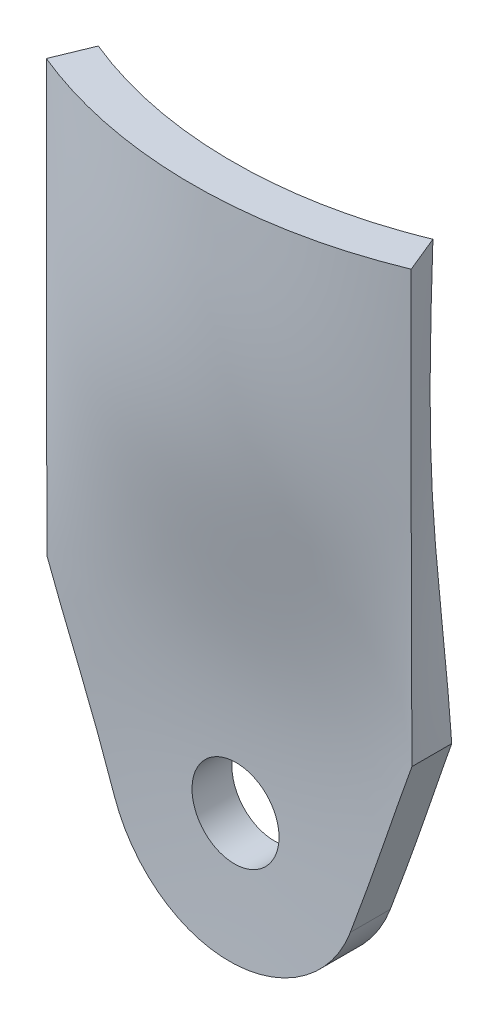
ISO-10303-21;
HEADER;
FILE_DESCRIPTION(('STEP AP214'),'2;1');
FILE_NAME('part.step','',(''),(''),'','','');
FILE_SCHEMA(('AUTOMOTIVE_DESIGN { 1 0 10303 214 1 1 1 1 }'));
ENDSEC;
DATA;
#1=APPLICATION_CONTEXT('core data for automotive mechanical design processes');
#2=APPLICATION_PROTOCOL_DEFINITION('international standard','automotive_design',2000,#1);
#3=PRODUCT_CONTEXT('',#1,'mechanical');
#4=PRODUCT('Part','Part','',(#3));
#5=PRODUCT_RELATED_PRODUCT_CATEGORY('part','',(#4));
#6=PRODUCT_DEFINITION_FORMATION('','',#4);
#7=PRODUCT_DEFINITION_CONTEXT('part definition',#1,'design');
#8=PRODUCT_DEFINITION('design','',#6,#7);
#9=PRODUCT_DEFINITION_SHAPE('','',#8);
#10=(LENGTH_UNIT() NAMED_UNIT(*) SI_UNIT(.MILLI.,.METRE.));
#11=(NAMED_UNIT(*) PLANE_ANGLE_UNIT() SI_UNIT($,.RADIAN.));
#12=(NAMED_UNIT(*) SI_UNIT($,.STERADIAN.) SOLID_ANGLE_UNIT());
#13=UNCERTAINTY_MEASURE_WITH_UNIT(LENGTH_MEASURE(1.E-05),#10,'distance_accuracy_value','');
#14=(GEOMETRIC_REPRESENTATION_CONTEXT(3) GLOBAL_UNCERTAINTY_ASSIGNED_CONTEXT((#13)) GLOBAL_UNIT_ASSIGNED_CONTEXT((#10,
#11,#12)) REPRESENTATION_CONTEXT('',''));
#15=CARTESIAN_POINT('',(0.,0.,0.));
#16=DIRECTION('',(0.,0.,1.));
#17=DIRECTION('',(1.,0.,0.));
#18=AXIS2_PLACEMENT_3D('',#15,#16,#17);
#19=CARTESIAN_POINT('',(27.6985551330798,35.052,6.14951913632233));
#20=CARTESIAN_POINT('',(27.698555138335,23.3475875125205,6.16319708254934));
#21=CARTESIAN_POINT('',(27.6985551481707,1.44104880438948,6.18879738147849));
#22=CARTESIAN_POINT('',(27.6985550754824,-33.2958353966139,5.99960558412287));
#23=CARTESIAN_POINT('',(27.698555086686,-56.6745810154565,6.02876615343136));
#24=CARTESIAN_POINT('',(27.698555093,-69.85,6.0452));
#25=CARTESIAN_POINT('',(9.95387424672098,35.052,13.4444482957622));
#26=CARTESIAN_POINT('',(10.0484121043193,23.3475875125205,14.4146108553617));
#27=CARTESIAN_POINT('',(10.2253536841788,1.44104880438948,16.2304135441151));
#28=CARTESIAN_POINT('',(8.9177167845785,-33.2958353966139,2.81123530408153));
#29=CARTESIAN_POINT('',(9.1192658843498,-56.6745810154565,4.87956428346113));
#30=CARTESIAN_POINT('',(9.23285169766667,-69.85,6.0452));
#31=CARTESIAN_POINT('',(-9.95387424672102,35.052,13.4444482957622));
#32=CARTESIAN_POINT('',(-10.0484121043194,23.3475875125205,14.4146108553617));
#33=CARTESIAN_POINT('',(-10.2253536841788,1.44104880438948,16.2304135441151));
#34=CARTESIAN_POINT('',(-8.91771678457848,-33.2958353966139,2.81123530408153));
#35=CARTESIAN_POINT('',(-9.11926588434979,-56.6745810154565,4.87956428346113));
#36=CARTESIAN_POINT('',(-9.23285169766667,-69.85,6.0452));
#37=CARTESIAN_POINT('',(-27.6985551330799,35.052,6.14951913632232));
#38=CARTESIAN_POINT('',(-27.698555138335,23.3475875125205,6.16319708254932));
#39=CARTESIAN_POINT('',(-27.6985551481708,1.44104880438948,6.18879738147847));
#40=CARTESIAN_POINT('',(-27.6985550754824,-33.2958353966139,5.99960558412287));
#41=CARTESIAN_POINT('',(-27.698555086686,-56.6745810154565,6.02876615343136));
#42=CARTESIAN_POINT('',(-27.698555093,-69.85,6.0452));
#43=B_SPLINE_SURFACE_WITH_KNOTS('',3,3,((#19,#20,#21,#22,#23,#24),(#25,#26,#27,#28,#29,#30),
(#31,#32,#33,#34,#35,#36),(#37,#38,#39,#40,#41,#42)),.UNSPECIFIED.,.F.,.F.,.F.,(4,4),(4,1,1,4),
(0.,1.),(0.,0.333645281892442,0.624466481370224,1.),.UNSPECIFIED.);
#44=CARTESIAN_POINT('',(-6.604,-50.8,5.12480998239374));
#45=CARTESIAN_POINT('',(-6.60400134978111,-50.6144803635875,5.12127502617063));
#46=CARTESIAN_POINT('',(-6.59617938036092,-50.4289807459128,5.11784925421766));
#47=CARTESIAN_POINT('',(-6.56494505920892,-50.0592335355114,5.11124221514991));
#48=CARTESIAN_POINT('',(-6.54152862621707,-49.8749862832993,5.108061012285));
#49=CARTESIAN_POINT('',(-6.47923724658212,-49.5089541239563,5.10196573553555));
#50=CARTESIAN_POINT('',(-6.44034861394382,-49.3271715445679,5.09905190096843));
#51=CARTESIAN_POINT('',(-6.34737205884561,-48.967459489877,5.09351260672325));
#52=CARTESIAN_POINT('',(-6.29327858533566,-48.7895314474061,5.0908872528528));
#53=CARTESIAN_POINT('',(-6.17033369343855,-48.4390119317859,5.08594174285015));
#54=CARTESIAN_POINT('',(-6.10149461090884,-48.2664161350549,5.08362133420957));
#55=CARTESIAN_POINT('',(-5.9494924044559,-47.9275709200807,5.07928937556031));
#56=CARTESIAN_POINT('',(-5.86632400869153,-47.7613238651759,5.07727793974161));
#57=CARTESIAN_POINT('',(-5.68632744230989,-47.4365273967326,5.0735660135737));
#58=CARTESIAN_POINT('',(-5.58950772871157,-47.2779732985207,5.07186533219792));
#59=CARTESIAN_POINT('',(-5.38281926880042,-46.9695234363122,5.0687651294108));
#60=CARTESIAN_POINT('',(-5.27294572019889,-46.8196308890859,5.06736571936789));
#61=CARTESIAN_POINT('',(-5.0410076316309,-46.5296945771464,5.06485395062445));
#62=CARTESIAN_POINT('',(-4.91894817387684,-46.3896467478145,5.06374147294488));
#63=CARTESIAN_POINT('',(-4.66342021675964,-46.1202773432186,5.06177961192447));
#64=CARTESIAN_POINT('',(-4.5299475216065,-45.9909597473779,5.06093032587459));
#65=CARTESIAN_POINT('',(-4.25262696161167,-45.7440694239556,5.05946616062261));
#66=CARTESIAN_POINT('',(-4.10878253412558,-45.6264928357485,5.05885120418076));
#67=CARTESIAN_POINT('',(-3.81164692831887,-45.4038306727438,5.0578203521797));
#68=CARTESIAN_POINT('',(-3.65835228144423,-45.2987497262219,5.05740453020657));
#69=CARTESIAN_POINT('',(-3.34351713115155,-45.1019159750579,5.05673411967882));
#70=CARTESIAN_POINT('',(-3.18197993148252,-45.0101578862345,5.05647946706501));
#71=CARTESIAN_POINT('',(-2.8516907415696,-44.8405407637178,5.05609150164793));
#72=CARTESIAN_POINT('',(-2.6829361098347,-44.7626868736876,5.05595823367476));
#73=CARTESIAN_POINT('',(-2.33953041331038,-44.6214998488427,5.05577473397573));
#74=CARTESIAN_POINT('',(-2.16488155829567,-44.5581613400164,5.05572447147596));
#75=CARTESIAN_POINT('',(-1.81080823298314,-44.4463968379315,5.05567207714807));
#76=CARTESIAN_POINT('',(-1.63138202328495,-44.3979763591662,5.05566996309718));
#77=CARTESIAN_POINT('',(-1.26912714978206,-44.3164382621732,5.05568481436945));
#78=CARTESIAN_POINT('',(-1.0862994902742,-44.2833161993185,5.0557017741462));
#79=CARTESIAN_POINT('',(-0.718487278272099,-44.2325709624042,5.05573441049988));
#80=CARTESIAN_POINT('',(-0.533501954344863,-44.2149535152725,5.05575008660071));
#81=CARTESIAN_POINT('',(0.0225816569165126,-44.1856413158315,5.05577442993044));
#82=CARTESIAN_POINT('',(0.395202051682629,-44.1973982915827,5.05576049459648));
#83=CARTESIAN_POINT('',(1.13298280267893,-44.2833061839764,5.05569956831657));
#84=CARTESIAN_POINT('',(1.49814303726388,-44.3574581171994,5.05565257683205));
#85=CARTESIAN_POINT('',(2.21088660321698,-44.5660138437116,5.05571328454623));
#86=CARTESIAN_POINT('',(2.55846991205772,-44.7004177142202,5.05582098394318));
#87=CARTESIAN_POINT('',(3.2261227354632,-45.0256717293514,5.05648118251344));
#88=CARTESIAN_POINT('',(3.54619233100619,-45.2165217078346,5.05703368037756));
#89=CARTESIAN_POINT('',(4.1497500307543,-45.6492463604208,5.05890185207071));
#90=CARTESIAN_POINT('',(4.43323817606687,-45.8911209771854,5.06021752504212));
#91=CARTESIAN_POINT('',(4.95556452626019,-46.4190110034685,5.06388247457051));
#92=CARTESIAN_POINT('',(5.19440533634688,-46.7050238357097,5.06623169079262));
#93=CARTESIAN_POINT('',(5.6206797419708,-47.313076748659,5.0721327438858));
#94=CARTESIAN_POINT('',(5.8081133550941,-47.6351168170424,5.07568458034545));
#95=CARTESIAN_POINT('',(6.12624842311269,-48.3060606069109,5.08403649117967));
#96=CARTESIAN_POINT('',(6.256952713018,-48.6549629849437,5.08883650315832));
#97=CARTESIAN_POINT('',(6.45794056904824,-49.3697394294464,5.09961443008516));
#98=CARTESIAN_POINT('',(6.52822409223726,-49.7356135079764,5.10559234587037));
#99=CARTESIAN_POINT('',(6.6063903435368,-50.4740025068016,5.11856293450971));
#100=CARTESIAN_POINT('',(6.61426418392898,-50.8465183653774,5.12555575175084));
#101=CARTESIAN_POINT('',(6.56737300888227,-51.5875709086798,5.14032106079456));
#102=CARTESIAN_POINT('',(6.51260789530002,-51.9561075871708,5.14809355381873));
#103=CARTESIAN_POINT('',(6.34197507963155,-52.6788488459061,5.16413032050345));
#104=CARTESIAN_POINT('',(6.22609065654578,-53.0330494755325,5.17239472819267));
#105=CARTESIAN_POINT('',(5.93650059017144,-53.716963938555,5.18907267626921));
#106=CARTESIAN_POINT('',(5.76279486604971,-54.0466777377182,5.19748621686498));
#107=CARTESIAN_POINT('',(5.36245078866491,-54.6723231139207,5.21407562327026));
#108=CARTESIAN_POINT('',(5.13580270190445,-54.9682484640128,5.22225144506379));
#109=CARTESIAN_POINT('',(4.63602379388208,-55.5178457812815,5.23793753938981));
#110=CARTESIAN_POINT('',(4.36289295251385,-55.7715177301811,5.24544781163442));
#111=CARTESIAN_POINT('',(3.77790610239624,-56.229379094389,5.2593621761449));
#112=CARTESIAN_POINT('',(3.46605396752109,-56.4335734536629,5.26576637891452));
#113=CARTESIAN_POINT('',(2.81252134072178,-56.786700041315,5.27705506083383));
#114=CARTESIAN_POINT('',(2.4708409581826,-56.9356324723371,5.28193954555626));
#115=CARTESIAN_POINT('',(1.76724924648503,-57.1739580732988,5.2898454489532));
#116=CARTESIAN_POINT('',(1.40534668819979,-57.2633768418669,5.29286766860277));
#117=CARTESIAN_POINT('',(0.855451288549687,-57.3510046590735,5.29584116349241));
#118=CARTESIAN_POINT('',(0.670878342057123,-57.3724628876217,5.29657232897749));
#119=CARTESIAN_POINT('',(0.300598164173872,-57.3997615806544,5.29750328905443));
#120=CARTESIAN_POINT('',(0.114891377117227,-57.4056078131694,5.2977032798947));
#121=CARTESIAN_POINT('',(-0.256326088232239,-57.4016349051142,5.29756761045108));
#122=CARTESIAN_POINT('',(-0.441836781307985,-57.3918170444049,5.29723199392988));
#123=CARTESIAN_POINT('',(-0.811305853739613,-57.3566010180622,5.29603204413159));
#124=CARTESIAN_POINT('',(-0.995264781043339,-57.3312086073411,5.29516790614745));
#125=CARTESIAN_POINT('',(-1.36045575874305,-57.2650156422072,5.29292679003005));
#126=CARTESIAN_POINT('',(-1.54168677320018,-57.2242093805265,5.29154962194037));
#127=CARTESIAN_POINT('',(-1.89999857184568,-57.1274989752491,5.28830857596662));
#128=CARTESIAN_POINT('',(-2.07708086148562,-57.071600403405,5.2864448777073));
#129=CARTESIAN_POINT('',(-2.42597384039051,-56.9450723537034,5.28226346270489));
#130=CARTESIAN_POINT('',(-2.59778247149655,-56.8744372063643,5.27994557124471));
#131=CARTESIAN_POINT('',(-2.93477403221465,-56.718981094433,5.27489802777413));
#132=CARTESIAN_POINT('',(-3.09995938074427,-56.6341653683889,5.27216852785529));
#133=CARTESIAN_POINT('',(-3.42265295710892,-56.4509028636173,5.26634266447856));
#134=CARTESIAN_POINT('',(-3.58015862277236,-56.3524515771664,5.26324617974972));
#135=CARTESIAN_POINT('',(-3.88625989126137,-56.1426784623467,5.25673897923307));
#136=CARTESIAN_POINT('',(-4.03485875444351,-56.0313613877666,5.25332837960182));
#137=CARTESIAN_POINT('',(-4.32225823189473,-55.796534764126,5.24624276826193));
#138=CARTESIAN_POINT('',(-4.46105181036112,-55.6730166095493,5.24256757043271));
#139=CARTESIAN_POINT('',(-4.72769023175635,-55.4147799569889,5.23501095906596));
#140=CARTESIAN_POINT('',(-4.85553908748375,-55.2800656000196,5.23112962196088));
#141=CARTESIAN_POINT('',(-5.09951435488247,-55.0002670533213,5.22321159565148));
#142=CARTESIAN_POINT('',(-5.21563346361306,-54.8551764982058,5.21917481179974));
#143=CARTESIAN_POINT('',(-5.4351941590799,-54.5557859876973,5.21100323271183));
#144=CARTESIAN_POINT('',(-5.53864039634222,-54.4014894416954,5.20686847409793));
#145=CARTESIAN_POINT('',(-5.7322948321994,-54.0845314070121,5.198545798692));
#146=CARTESIAN_POINT('',(-5.82248597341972,-53.9218594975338,5.19435782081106));
#147=CARTESIAN_POINT('',(-5.988800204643,-53.5895517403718,5.18598476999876));
#148=CARTESIAN_POINT('',(-6.06492842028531,-53.4199184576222,5.18179969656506));
#149=CARTESIAN_POINT('',(-6.20255529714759,-53.074987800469,5.17348097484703));
#150=CARTESIAN_POINT('',(-6.26406687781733,-52.899695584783,5.16934728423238));
#151=CARTESIAN_POINT('',(-6.37209462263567,-52.5446101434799,5.16117221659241));
#152=CARTESIAN_POINT('',(-6.41861471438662,-52.3648181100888,5.15713081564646));
#153=CARTESIAN_POINT('',(-6.5061348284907,-51.9562631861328,5.14817806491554));
#154=CARTESIAN_POINT('',(-6.54280251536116,-51.7265585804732,5.14330361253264));
#155=CARTESIAN_POINT('',(-6.59173425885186,-51.2645588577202,5.13383238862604));
#156=CARTESIAN_POINT('',(-6.60399831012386,-51.0322637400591,5.12923561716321));
#157=CARTESIAN_POINT('',(-6.604,-50.8,5.12480998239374));
#158=B_SPLINE_CURVE_WITH_KNOTS('',3,(#44,#45,#46,#47,#48,#49,#50,#51,#52,#53,#54,#55,#56,#57,
#58,#59,#60,#61,#62,#63,#64,#65,#66,#67,#68,#69,#70,#71,#72,#73,#74,#75,#76,#77,#78,#79,#80,#81,
#82,#83,#84,#85,#86,#87,#88,#89,#90,#91,#92,#93,#94,#95,#96,#97,#98,#99,#100,#101,#102,#103,
#104,#105,#106,#107,#108,#109,#110,#111,#112,#113,#114,#115,#116,#117,#118,#119,#120,#121,#122,
#123,#124,#125,#126,#127,#128,#129,#130,#131,#132,#133,#134,#135,#136,#137,#138,#139,#140,#141,
#142,#143,#144,#145,#146,#147,#148,#149,#150,#151,#152,#153,#154,#155,#156,#157),.UNSPECIFIED.,
.T.,.F.,(4,2,2,2,2,2,2,2,2,2,2,2,2,2,2,2,2,2,2,2,2,2,2,2,2,2,2,2,2,2,2,2,2,2,2,2,2,2,2,2,2,2,2,
2,2,2,2,2,2,2,2,2,2,2,2,2,4),(0.,0.556457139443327,1.11305996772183,1.67015623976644,
2.22745616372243,2.78429167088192,3.34133248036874,3.89802970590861,4.45493236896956,
5.01160373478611,5.56848063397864,6.12517381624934,6.68207255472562,7.23874980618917,
7.79563256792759,8.35230882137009,8.90919060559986,9.4659104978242,10.0228359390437,
11.1354893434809,12.2481608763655,13.3608338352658,14.4735035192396,15.5861719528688,
16.6987754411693,17.8113785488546,18.9239260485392,20.0364743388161,21.149181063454,
22.2618895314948,23.3749025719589,24.4879171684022,25.6011365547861,26.7143564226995,
27.8274650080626,28.9405695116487,30.0531949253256,30.6101053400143,31.1668099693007,
31.7234691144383,32.2799226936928,32.8365825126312,33.3930371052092,33.9497061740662,
34.5061700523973,35.0628183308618,35.6192615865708,36.1761001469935,36.7327336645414,
37.289711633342,37.8464845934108,38.4039678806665,38.9612475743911,39.5180328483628,
40.0746721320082,40.771335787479,41.4679995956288),.UNSPECIFIED.);
#159=CARTESIAN_POINT('',(-6.604,-50.8,5.12480998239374));
#160=VERTEX_POINT('',#159);
#161=EDGE_CURVE('E488',#160,#160,#158,.T.);
#162=CARTESIAN_POINT('',(-27.6985551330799,35.052,6.14951913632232));
#163=CARTESIAN_POINT('',(-27.698555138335,23.3475875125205,6.16319708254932));
#164=CARTESIAN_POINT('',(-27.6985551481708,1.44104880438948,6.18879738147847));
#165=CARTESIAN_POINT('',(-27.6985550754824,-33.2958353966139,5.99960558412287));
#166=CARTESIAN_POINT('',(-27.698555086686,-56.6745810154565,6.02876615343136));
#167=CARTESIAN_POINT('',(-27.698555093,-69.85,6.0452));
#168=B_SPLINE_CURVE_WITH_KNOTS('',3,(#162,#163,#164,#165,#166,#167),.UNSPECIFIED.,.F.,.F.,(4,1,
1,4),(0.,0.333645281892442,0.624466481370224,1.),.UNSPECIFIED.);
#169=CARTESIAN_POINT('',(-27.6985551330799,35.052,6.14951913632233));
#170=VERTEX_POINT('',#169);
#171=CARTESIAN_POINT('',(-27.698555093,-30.397318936,6.0452));
#172=VERTEX_POINT('',#171);
#173=EDGE_CURVE('E487',#170,#172,#168,.T.);
#174=CARTESIAN_POINT('',(-27.6985550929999,-30.3973190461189,6.04519999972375));
#175=CARTESIAN_POINT('',(-27.5352161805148,-30.8460890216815,6.04406383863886));
#176=CARTESIAN_POINT('',(-27.3718807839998,-31.2948493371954,6.04091719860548));
#177=CARTESIAN_POINT('',(-27.0452244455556,-32.1923302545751,6.03129605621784));
#178=CARTESIAN_POINT('',(-26.8819035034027,-32.6410508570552,6.02482162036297));
#179=CARTESIAN_POINT('',(-26.555293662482,-33.5384040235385,6.00923867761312));
#180=CARTESIAN_POINT('',(-26.3920047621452,-33.9870365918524,6.0001304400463));
#181=CARTESIAN_POINT('',(-26.0654408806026,-34.8842634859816,5.97989804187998));
#182=CARTESIAN_POINT('',(-25.9021658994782,-35.3328578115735,5.968773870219));
#183=CARTESIAN_POINT('',(-25.4123661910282,-36.678571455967,5.93325246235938));
#184=CARTESIAN_POINT('',(-25.0858601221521,-37.5756395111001,5.90670597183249));
#185=CARTESIAN_POINT('',(-24.4328700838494,-39.3697149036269,5.85189075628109));
#186=CARTESIAN_POINT('',(-24.1063861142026,-40.2667222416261,5.82362205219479));
#187=CARTESIAN_POINT('',(-23.4534121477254,-42.0607534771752,5.76862963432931));
#188=CARTESIAN_POINT('',(-23.1269221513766,-42.9577773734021,5.7419058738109));
#189=CARTESIAN_POINT('',(-22.4738697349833,-44.7520241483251,5.69262109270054));
#190=CARTESIAN_POINT('',(-22.1473073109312,-45.6492470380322,5.67006051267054));
#191=CARTESIAN_POINT('',(-21.4941559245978,-47.4437657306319,5.63112337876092));
#192=CARTESIAN_POINT('',(-21.1675669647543,-48.341061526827,5.61474648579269));
#193=CARTESIAN_POINT('',(-20.5143592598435,-50.135734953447,5.58962817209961));
#194=CARTESIAN_POINT('',(-20.1877405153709,-51.0331125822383,5.5808866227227));
#195=CARTESIAN_POINT('',(-19.5344708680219,-52.8279561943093,5.57196671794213));
#196=CARTESIAN_POINT('',(-19.2078199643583,-53.725422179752,5.57178881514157));
#197=CARTESIAN_POINT('',(-18.717832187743,-55.0716525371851,5.57826443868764));
#198=CARTESIAN_POINT('',(-18.5544894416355,-55.5204330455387,5.58154719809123));
#199=CARTESIAN_POINT('',(-18.2278108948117,-56.4179749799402,5.59036184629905));
#200=CARTESIAN_POINT('',(-18.0644750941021,-56.8667364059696,5.59589373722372));
#201=CARTESIAN_POINT('',(-17.9011444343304,-57.3154837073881,5.60255074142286));
#202=B_SPLINE_CURVE_WITH_KNOTS('',3,(#174,#175,#176,#177,#178,#179,#180,#181,#182,#183,#184,
#185,#186,#187,#188,#189,#190,#191,#192,#193,#194,#195,#196,#197,#198,#199,#200,#201),
.UNSPECIFIED.,.F.,.F.,(4,2,2,2,2,2,2,2,2,2,2,2,2,4),(0.,1.43270503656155,2.86538144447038,
4.29791140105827,5.73044921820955,8.59546715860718,11.4604502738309,14.325346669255,
17.1905460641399,20.055588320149,22.9205823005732,25.7857277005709,27.2185036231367,
28.6512808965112),.UNSPECIFIED.);
#203=CARTESIAN_POINT('',(-17.9011444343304,-57.3154837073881,5.60255074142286));
#204=VERTEX_POINT('',#203);
#205=EDGE_CURVE('E424',#172,#204,#202,.T.);
#206=CARTESIAN_POINT('',(-17.9011444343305,-57.3154837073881,5.60255074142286));
#207=CARTESIAN_POINT('',(-17.7789782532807,-57.6511659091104,5.60752486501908));
#208=CARTESIAN_POINT('',(-17.6473506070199,-57.9833999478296,5.61271066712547));
#209=CARTESIAN_POINT('',(-17.3656433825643,-58.6399236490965,5.62356497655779));
#210=CARTESIAN_POINT('',(-17.215564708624,-58.9642137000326,5.62923346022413));
#211=CARTESIAN_POINT('',(-16.8974170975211,-59.6038289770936,5.64111285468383));
#212=CARTESIAN_POINT('',(-16.7293484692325,-59.9191543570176,5.64732375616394));
#213=CARTESIAN_POINT('',(-16.3758870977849,-60.5396202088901,5.66031634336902));
#214=CARTESIAN_POINT('',(-16.1905071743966,-60.8447679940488,5.66709760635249));
#215=CARTESIAN_POINT('',(-15.8029031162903,-61.444158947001,5.6812433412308));
#216=CARTESIAN_POINT('',(-15.6006791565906,-61.7384022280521,5.68860780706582));
#217=CARTESIAN_POINT('',(-15.1800443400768,-62.315039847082,5.70389834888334));
#218=CARTESIAN_POINT('',(-14.9616335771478,-62.5974342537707,5.71182442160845));
#219=CARTESIAN_POINT('',(-14.3960788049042,-63.2876753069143,5.7322878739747));
#220=CARTESIAN_POINT('',(-14.0392016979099,-63.6875955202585,5.74514824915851));
#221=CARTESIAN_POINT('',(-13.2929730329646,-64.455995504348,5.77174729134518));
#222=CARTESIAN_POINT('',(-12.90361718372,-64.8244711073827,5.78548607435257));
#223=CARTESIAN_POINT('',(-12.2974715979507,-65.3515098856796,5.80643566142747));
#224=CARTESIAN_POINT('',(-12.0917245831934,-65.522920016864,5.81347619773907));
#225=CARTESIAN_POINT('',(-11.6732516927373,-65.8568701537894,5.82760829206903));
#226=CARTESIAN_POINT('',(-11.4605277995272,-66.0194126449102,5.83469983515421));
#227=CARTESIAN_POINT('',(-10.812315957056,-66.49339927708,5.85595879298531));
#228=CARTESIAN_POINT('',(-10.3667532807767,-66.7912326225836,5.87011174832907));
#229=CARTESIAN_POINT('',(-9.45194998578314,-67.3484201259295,5.89781776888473));
#230=CARTESIAN_POINT('',(-8.98269799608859,-67.6077555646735,5.91137054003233));
#231=CARTESIAN_POINT('',(-8.02396796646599,-68.0859874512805,5.93729569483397));
#232=CARTESIAN_POINT('',(-7.53448988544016,-68.3048838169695,5.9496680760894));
#233=CARTESIAN_POINT('',(-6.53872841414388,-68.700688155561,5.97268603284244));
#234=CARTESIAN_POINT('',(-6.03244270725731,-68.8775903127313,5.98333136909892));
#235=CARTESIAN_POINT('',(-5.00672333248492,-69.1881033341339,6.00240978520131));
#236=CARTESIAN_POINT('',(-4.48728968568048,-69.3217142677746,6.01084286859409));
#237=CARTESIAN_POINT('',(-3.43941539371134,-69.544588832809,6.02510188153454));
#238=CARTESIAN_POINT('',(-2.91098268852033,-69.6338896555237,6.0309299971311));
#239=CARTESIAN_POINT('',(-1.84844962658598,-69.767668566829,6.03971887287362));
#240=CARTESIAN_POINT('',(-1.31434927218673,-69.8121466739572,6.04267963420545));
#241=CARTESIAN_POINT('',(-0.244327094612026,-69.8559571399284,6.04559566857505));
#242=CARTESIAN_POINT('',(0.291594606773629,-69.8552924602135,6.04555113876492));
#243=CARTESIAN_POINT('',(1.36146871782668,-69.8088295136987,6.04245915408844));
#244=CARTESIAN_POINT('',(1.89542112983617,-69.7630313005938,6.03941170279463));
#245=CARTESIAN_POINT('',(2.9565991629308,-69.6267543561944,6.03046395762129));
#246=CARTESIAN_POINT('',(3.48383508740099,-69.5363555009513,6.02456876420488));
#247=CARTESIAN_POINT('',(4.52880699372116,-69.3115648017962,6.01020042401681));
#248=CARTESIAN_POINT('',(5.04654298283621,-69.1771729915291,6.00172727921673));
#249=CARTESIAN_POINT('',(6.06883095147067,-68.8653634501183,5.98259188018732));
#250=CARTESIAN_POINT('',(6.57338337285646,-68.6879471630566,5.97192969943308));
#251=CARTESIAN_POINT('',(7.56575666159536,-68.2913507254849,5.94889746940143));
#252=CARTESIAN_POINT('',(8.05357753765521,-68.0721705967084,5.93652742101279));
#253=CARTESIAN_POINT('',(9.00951808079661,-67.5933657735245,5.91061087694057));
#254=CARTESIAN_POINT('',(9.4776178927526,-67.3337015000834,5.89706323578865));
#255=CARTESIAN_POINT('',(10.390305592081,-66.7759219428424,5.86937429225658));
#256=CARTESIAN_POINT('',(10.8348932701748,-66.4778063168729,5.8552329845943));
#257=CARTESIAN_POINT('',(11.697583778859,-65.845108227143,5.82690986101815));
#258=CARTESIAN_POINT('',(12.1156761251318,-65.5105114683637,5.81272803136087));
#259=CARTESIAN_POINT('',(12.9222148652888,-64.8073229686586,5.78483365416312));
#260=CARTESIAN_POINT('',(13.3106622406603,-64.4387323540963,5.77112109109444));
#261=CARTESIAN_POINT('',(14.0559826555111,-63.669318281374,5.74454554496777));
#262=CARTESIAN_POINT('',(14.4127853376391,-63.2684266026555,5.73168447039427));
#263=CARTESIAN_POINT('',(15.0913725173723,-62.4378935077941,5.7071289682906));
#264=CARTESIAN_POINT('',(15.4131521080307,-62.0082480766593,5.69543470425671));
#265=CARTESIAN_POINT('',(16.018848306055,-61.1240381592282,5.67337363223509));
#266=CARTESIAN_POINT('',(16.302823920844,-60.6695141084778,5.66300475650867));
#267=CARTESIAN_POINT('',(16.8313740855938,-59.7383279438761,5.64357059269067));
#268=CARTESIAN_POINT('',(17.0759699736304,-59.2616780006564,5.63450459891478));
#269=CARTESIAN_POINT('',(17.4103293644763,-58.5364339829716,5.62184299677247));
#270=CARTESIAN_POINT('',(17.5156561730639,-58.2949120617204,5.61780684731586));
#271=CARTESIAN_POINT('',(17.7160605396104,-57.8080578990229,5.6099936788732));
#272=CARTESIAN_POINT('',(17.811152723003,-57.5627316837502,5.60621629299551));
#273=CARTESIAN_POINT('',(17.9011348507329,-57.3155100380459,5.60255113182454));
#274=B_SPLINE_CURVE_WITH_KNOTS('',3,(#206,#207,#208,#209,#210,#211,#212,#213,#214,#215,#216,
#217,#218,#219,#220,#221,#222,#223,#224,#225,#226,#227,#228,#229,#230,#231,#232,#233,#234,#235,
#236,#237,#238,#239,#240,#241,#242,#243,#244,#245,#246,#247,#248,#249,#250,#251,#252,#253,#254,
#255,#256,#257,#258,#259,#260,#261,#262,#263,#264,#265,#266,#267,#268,#269,#270,#271,#272,#273),
.UNSPECIFIED.,.F.,.F.,(4,2,2,2,2,2,2,2,2,2,2,2,2,2,2,2,2,2,2,2,2,2,2,2,2,2,2,2,2,2,2,2,2,4),(0.,
1.07162451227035,2.14319652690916,3.21475014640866,4.28551643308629,5.35627159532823,
6.42702054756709,8.03351183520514,9.64021571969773,10.4436653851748,11.2468886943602,
12.8531983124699,14.460286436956,16.0673778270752,17.674691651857,19.2820028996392,
20.8879627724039,22.4939219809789,24.0997758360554,25.70562778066,27.3086141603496,
28.911599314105,30.5145306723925,32.1174611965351,33.7219687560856,35.3264905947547,
36.9316434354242,38.5367431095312,40.1453264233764,41.7541348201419,43.3604018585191,
44.9657955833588,45.7561612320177,46.545382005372),.UNSPECIFIED.);
#275=CARTESIAN_POINT('',(17.9011348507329,-57.3155100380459,5.60255113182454));
#276=VERTEX_POINT('',#275);
#277=EDGE_CURVE('E626',#204,#276,#274,.T.);
#278=CARTESIAN_POINT('',(17.9011348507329,-57.3155100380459,5.60255113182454));
#279=CARTESIAN_POINT('',(18.0644656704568,-56.8667643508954,5.59589413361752));
#280=CARTESIAN_POINT('',(18.2278016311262,-56.4180045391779,5.59036224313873));
#281=CARTESIAN_POINT('',(18.5544804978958,-55.5204658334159,5.58154758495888));
#282=CARTESIAN_POINT('',(18.7178234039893,-55.0716869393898,5.57826481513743));
#283=CARTESIAN_POINT('',(19.2078116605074,-53.7254614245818,5.57178914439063));
#284=CARTESIAN_POINT('',(19.5344628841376,-52.8279986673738,5.57196699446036));
#285=CARTESIAN_POINT('',(20.18773317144,-51.0331615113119,5.58088675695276));
#286=CARTESIAN_POINT('',(20.5143522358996,-50.135787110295,5.58962821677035));
#287=CARTESIAN_POINT('',(21.1675605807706,-48.341120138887,5.61474632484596));
#288=CARTESIAN_POINT('',(21.4941498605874,-47.4438275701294,5.63112310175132));
#289=CARTESIAN_POINT('',(22.1473018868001,-45.6493153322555,5.67005999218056));
#290=CARTESIAN_POINT('',(22.4738646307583,-44.7520956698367,5.69262044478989));
#291=CARTESIAN_POINT('',(23.1269176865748,-42.9578553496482,5.7419049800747));
#292=CARTESIAN_POINT('',(23.4534080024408,-42.0608346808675,5.76862862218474));
#293=CARTESIAN_POINT('',(24.1063826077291,-40.2668099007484,5.82362083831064));
#294=CARTESIAN_POINT('',(24.4328668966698,-39.3698057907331,5.85188945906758));
#295=CARTESIAN_POINT('',(25.0858575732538,-37.5757368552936,5.90670457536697));
#296=CARTESIAN_POINT('',(25.4123639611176,-36.678672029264,5.93325104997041));
#297=CARTESIAN_POINT('',(25.9021641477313,-35.3329632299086,5.96877251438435));
#298=CARTESIAN_POINT('',(26.0654392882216,-34.8843705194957,5.97989671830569));
#299=CARTESIAN_POINT('',(26.3920034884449,-33.9871468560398,6.00012921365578));
#300=CARTESIAN_POINT('',(26.5552925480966,-33.5385159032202,6.00923751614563));
#301=CARTESIAN_POINT('',(26.8819027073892,-32.6411659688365,6.02482062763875));
#302=CARTESIAN_POINT('',(27.045223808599,-32.192446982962,6.03129516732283));
#303=CARTESIAN_POINT('',(27.3718804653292,-31.2949692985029,6.04091656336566));
#304=CARTESIAN_POINT('',(27.5352160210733,-30.846210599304,6.04406335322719));
#305=CARTESIAN_POINT('',(27.6985550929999,-30.3974422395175,6.0451996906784));
#306=B_SPLINE_CURVE_WITH_KNOTS('',3,(#278,#279,#280,#281,#282,#283,#284,#285,#286,#287,#288,
#289,#290,#291,#292,#293,#294,#295,#296,#297,#298,#299,#300,#301,#302,#303,#304,#305),
.UNSPECIFIED.,.F.,.F.,(4,2,2,2,2,2,2,2,2,2,2,2,2,4),(0.,1.43277288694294,2.86554442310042,
5.73068105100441,8.59566625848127,11.4606997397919,14.3258903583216,17.1907779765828,
20.0557523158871,22.9207614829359,24.3532949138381,25.7858204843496,27.2184925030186,
28.6511931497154),.UNSPECIFIED.);
#307=CARTESIAN_POINT('',(27.6985550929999,-30.3974422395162,6.0451996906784));
#308=VERTEX_POINT('',#307);
#309=EDGE_CURVE('E606',#276,#308,#306,.T.);
#310=CARTESIAN_POINT('',(27.6985551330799,35.052,6.14951913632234));
#311=CARTESIAN_POINT('',(27.698555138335,23.3475875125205,6.16319708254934));
#312=CARTESIAN_POINT('',(27.6985551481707,1.44104880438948,6.18879738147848));
#313=CARTESIAN_POINT('',(27.6985550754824,-33.2958353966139,5.99960558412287));
#314=CARTESIAN_POINT('',(27.698555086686,-56.6745810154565,6.02876615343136));
#315=CARTESIAN_POINT('',(27.698555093,-69.85,6.0452));
#316=B_SPLINE_CURVE_WITH_KNOTS('',3,(#310,#311,#312,#313,#314,#315),.UNSPECIFIED.,.F.,.F.,(4,1,
1,4),(0.,0.333645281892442,0.624466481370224,1.),.UNSPECIFIED.);
#317=CARTESIAN_POINT('',(27.6985551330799,35.052,6.14951913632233));
#318=VERTEX_POINT('',#317);
#319=EDGE_CURVE('E630',#318,#308,#316,.T.);
#320=CARTESIAN_POINT('',(27.6985551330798,35.052,6.14951913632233));
#321=CARTESIAN_POINT('',(9.95387424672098,35.052,13.4444482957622));
#322=CARTESIAN_POINT('',(-9.95387424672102,35.052,13.4444482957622));
#323=CARTESIAN_POINT('',(-27.6985551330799,35.052,6.14951913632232));
#324=B_SPLINE_CURVE_WITH_KNOTS('',3,(#320,#321,#322,#323),.UNSPECIFIED.,.F.,.F.,(4,4),(0.,1.),.UNSPECIFIED.);
#325=EDGE_CURVE('E629',#170,#318,#324,.F.);
#326=ORIENTED_EDGE('',*,*,#161,.T.);
#327=EDGE_LOOP('',(#326));
#328=FACE_BOUND('',#327,.T.);
#329=ORIENTED_EDGE('',*,*,#173,.T.);
#330=ORIENTED_EDGE('',*,*,#205,.T.);
#331=ORIENTED_EDGE('',*,*,#277,.T.);
#332=ORIENTED_EDGE('',*,*,#309,.T.);
#333=ORIENTED_EDGE('',*,*,#319,.F.);
#334=ORIENTED_EDGE('',*,*,#325,.F.);
#335=EDGE_LOOP('',(#329,#330,#331,#332,#333,#334));
#336=FACE_BOUND('',#335,.T.);
#337=ADVANCED_FACE('F403',(#328,#336),#43,.T.);
#338=CARTESIAN_POINT('',(-25.4,35.052,0.558357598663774));
#339=CARTESIAN_POINT('',(-25.0986218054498,23.3475875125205,0.631567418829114));
#340=CARTESIAN_POINT('',(-24.5345479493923,1.44104880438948,0.768590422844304));
#341=CARTESIAN_POINT('',(-28.703176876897,-33.2958353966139,-0.244039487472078));
#342=CARTESIAN_POINT('',(-28.0606564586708,-56.6745810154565,-0.0879604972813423));
#343=CARTESIAN_POINT('',(-27.698555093,-69.85,0.));
#344=CARTESIAN_POINT('',(-9.12785539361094,35.052,7.24791955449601));
#345=CARTESIAN_POINT('',(-9.11408865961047,23.3475875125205,8.19824043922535));
#346=CARTESIAN_POINT('',(-9.08832218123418,1.44104880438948,9.97690649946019));
#347=CARTESIAN_POINT('',(-9.27874208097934,-33.2958353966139,-3.1678239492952));
#348=CARTESIAN_POINT('',(-9.24939222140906,-56.6745810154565,-1.14179624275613));
#349=CARTESIAN_POINT('',(-9.23285169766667,-69.85,0.));
#350=CARTESIAN_POINT('',(9.12785539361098,35.052,7.24791955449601));
#351=CARTESIAN_POINT('',(9.11408865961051,23.3475875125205,8.19824043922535));
#352=CARTESIAN_POINT('',(9.08832218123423,1.44104880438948,9.97690649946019));
#353=CARTESIAN_POINT('',(9.27874208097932,-33.2958353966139,-3.1678239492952));
#354=CARTESIAN_POINT('',(9.24939222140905,-56.6745810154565,-1.14179624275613));
#355=CARTESIAN_POINT('',(9.23285169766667,-69.85,0.));
#356=CARTESIAN_POINT('',(25.4,35.052,0.558357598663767));
#357=CARTESIAN_POINT('',(25.0986218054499,23.3475875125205,0.631567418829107));
#358=CARTESIAN_POINT('',(24.5345479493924,1.44104880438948,0.768590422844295));
#359=CARTESIAN_POINT('',(28.703176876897,-33.2958353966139,-0.244039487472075));
#360=CARTESIAN_POINT('',(28.0606564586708,-56.6745810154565,-0.0879604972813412));
#361=CARTESIAN_POINT('',(27.698555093,-69.85,0.));
#362=B_SPLINE_SURFACE_WITH_KNOTS('',3,3,((#338,#339,#340,#341,#342,#343),(#344,#345,#346,#347,
#348,#349),(#350,#351,#352,#353,#354,#355),(#356,#357,#358,#359,#360,#361)),.UNSPECIFIED.,.F.,
.F.,.F.,(4,4),(4,1,1,4),(0.,1.),(0.,0.333645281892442,0.624466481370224,1.),.UNSPECIFIED.);
#363=CARTESIAN_POINT('',(-6.604,-50.8,-0.926391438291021));
#364=CARTESIAN_POINT('',(-6.60400133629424,-50.9855897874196,-0.922826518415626));
#365=CARTESIAN_POINT('',(-6.59617344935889,-51.1711552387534,-0.919137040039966));
#366=CARTESIAN_POINT('',(-6.5649177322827,-51.5410241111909,-0.911541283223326));
#367=CARTESIAN_POINT('',(-6.5414857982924,-51.7253271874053,-0.907634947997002));
#368=CARTESIAN_POINT('',(-6.47915596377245,-52.0914615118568,-0.899641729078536));
#369=CARTESIAN_POINT('',(-6.4402442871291,-52.2732904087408,-0.895554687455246));
#370=CARTESIAN_POINT('',(-6.34721623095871,-52.6330848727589,-0.887244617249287));
#371=CARTESIAN_POINT('',(-6.29309429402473,-52.8110490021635,-0.883021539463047));
#372=CARTESIAN_POINT('',(-6.17008991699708,-53.1616279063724,-0.87449117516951));
#373=CARTESIAN_POINT('',(-6.10122009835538,-53.3342471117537,-0.870183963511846));
#374=CARTESIAN_POINT('',(-5.94915428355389,-53.6731312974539,-0.861530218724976));
#375=CARTESIAN_POINT('',(-5.86595301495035,-53.8393939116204,-0.857183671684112));
#376=CARTESIAN_POINT('',(-5.68588905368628,-54.1642151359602,-0.848508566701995));
#377=CARTESIAN_POINT('',(-5.58903482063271,-54.3227784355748,-0.84417999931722));
#378=CARTESIAN_POINT('',(-5.38227549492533,-54.6312418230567,-0.835592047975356));
#379=CARTESIAN_POINT('',(-5.27236559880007,-54.7811386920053,-0.831332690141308));
#380=CARTESIAN_POINT('',(-5.04032332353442,-55.071116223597,-0.822942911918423));
#381=CARTESIAN_POINT('',(-4.91819296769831,-55.2111985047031,-0.818812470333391));
#382=CARTESIAN_POINT('',(-4.66251428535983,-55.4806281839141,-0.81073672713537));
#383=CARTESIAN_POINT('',(-4.52896175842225,-55.6099715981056,-0.806791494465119));
#384=CARTESIAN_POINT('',(-4.25147237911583,-55.8569043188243,-0.799147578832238));
#385=CARTESIAN_POINT('',(-4.10753897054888,-55.9744974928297,-0.795448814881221));
#386=CARTESIAN_POINT('',(-3.81021604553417,-56.1971825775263,-0.78835236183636));
#387=CARTESIAN_POINT('',(-3.65682305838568,-56.3022698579,-0.784954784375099));
#388=CARTESIAN_POINT('',(-3.341816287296,-56.4990832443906,-0.77851899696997));
#389=CARTESIAN_POINT('',(-3.18020760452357,-56.5908175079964,-0.775480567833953));
#390=CARTESIAN_POINT('',(-2.84977017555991,-56.7603795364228,-0.769810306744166));
#391=CARTESIAN_POINT('',(-2.68093878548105,-56.8382021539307,-0.767178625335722));
#392=CARTESIAN_POINT('',(-2.33737579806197,-56.9793173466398,-0.762369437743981));
#393=CARTESIAN_POINT('',(-2.16264643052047,-57.0426153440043,-0.760191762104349));
#394=CARTESIAN_POINT('',(-1.8084093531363,-57.1542882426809,-0.756327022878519));
#395=CARTESIAN_POINT('',(-1.62889990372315,-57.2026576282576,-0.754640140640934));
#396=CARTESIAN_POINT('',(-1.26658815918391,-57.2840569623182,-0.75178993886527));
#397=CARTESIAN_POINT('',(-1.08378896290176,-57.3171006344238,-0.75062615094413));
#398=CARTESIAN_POINT('',(-0.716037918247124,-57.3676953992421,-0.748840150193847));
#399=CARTESIAN_POINT('',(-0.531085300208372,-57.3852407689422,-0.748218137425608));
#400=CARTESIAN_POINT('',(0.0248918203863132,-57.4143459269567,-0.747187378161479));
#401=CARTESIAN_POINT('',(0.397431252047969,-57.4024632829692,-0.747610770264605));
#402=CARTESIAN_POINT('',(1.13487952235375,-57.3163509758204,-0.750653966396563));
#403=CARTESIAN_POINT('',(1.49979115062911,-57.2421445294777,-0.753272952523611));
#404=CARTESIAN_POINT('',(2.2120277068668,-57.0335670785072,-0.760514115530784));
#405=CARTESIAN_POINT('',(2.5593526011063,-56.8991959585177,-0.765136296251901));
#406=CARTESIAN_POINT('',(3.22656036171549,-56.5740712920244,-0.776062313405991));
#407=CARTESIAN_POINT('',(3.54643823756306,-56.3833075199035,-0.782366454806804));
#408=CARTESIAN_POINT('',(4.14963745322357,-55.9508288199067,-0.796240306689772));
#409=CARTESIAN_POINT('',(4.43295869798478,-55.7091137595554,-0.803810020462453));
#410=CARTESIAN_POINT('',(4.95515877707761,-55.1814467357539,-0.819757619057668));
#411=CARTESIAN_POINT('',(5.19401370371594,-54.8954711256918,-0.828135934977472));
#412=CARTESIAN_POINT('',(5.62032702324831,-54.287489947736,-0.845230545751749));
#413=CARTESIAN_POINT('',(5.80778529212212,-53.9654842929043,-0.853946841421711));
#414=CARTESIAN_POINT('',(6.12605060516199,-53.2944472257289,-0.871280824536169));
#415=CARTESIAN_POINT('',(6.2568364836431,-52.9454057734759,-0.879898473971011));
#416=CARTESIAN_POINT('',(6.4579403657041,-52.2303058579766,-0.896638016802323));
#417=CARTESIAN_POINT('',(6.52825835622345,-51.8642473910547,-0.904759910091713));
#418=CARTESIAN_POINT('',(6.60642236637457,-51.1255102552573,-0.920172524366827));
#419=CARTESIAN_POINT('',(6.61426967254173,-50.7528317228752,-0.9274632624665));
#420=CARTESIAN_POINT('',(6.567263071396,-50.0114299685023,-0.940948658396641));
#421=CARTESIAN_POINT('',(6.51240925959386,-49.6427067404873,-0.947143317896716));
#422=CARTESIAN_POINT('',(6.34157326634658,-48.9197947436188,-0.958256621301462));
#423=CARTESIAN_POINT('',(6.22560846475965,-48.5656018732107,-0.963175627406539));
#424=CARTESIAN_POINT('',(5.93584678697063,-47.8817027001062,-0.971669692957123));
#425=CARTESIAN_POINT('',(5.7620500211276,-47.5519963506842,-0.975244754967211));
#426=CARTESIAN_POINT('',(5.36160946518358,-46.9265246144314,-0.981106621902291));
#427=CARTESIAN_POINT('',(5.13498001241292,-46.6307500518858,-0.983393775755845));
#428=CARTESIAN_POINT('',(4.63528537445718,-46.0814392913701,-0.986868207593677));
#429=CARTESIAN_POINT('',(4.36222017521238,-45.8279031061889,-0.988055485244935));
#430=CARTESIAN_POINT('',(3.7774000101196,-45.3702774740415,-0.98962525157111));
#431=CARTESIAN_POINT('',(3.46564670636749,-45.1661859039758,-0.990007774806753));
#432=CARTESIAN_POINT('',(2.81235875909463,-44.8132327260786,-0.990318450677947));
#433=CARTESIAN_POINT('',(2.47082413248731,-44.6643710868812,-0.990246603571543));
#434=CARTESIAN_POINT('',(1.76737551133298,-44.4260754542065,-0.989981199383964));
#435=CARTESIAN_POINT('',(1.40545958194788,-44.3366471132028,-0.989787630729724));
#436=CARTESIAN_POINT('',(0.855550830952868,-44.2490082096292,-0.989577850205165));
#437=CARTESIAN_POINT('',(0.670974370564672,-44.2275468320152,-0.989521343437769));
#438=CARTESIAN_POINT('',(0.300688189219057,-44.2002424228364,-0.989448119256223));
#439=CARTESIAN_POINT('',(0.114978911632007,-44.1943936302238,-0.989431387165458));
#440=CARTESIAN_POINT('',(-0.256332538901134,-44.198362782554,-0.989442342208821));
#441=CARTESIAN_POINT('',(-0.441934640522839,-44.2081869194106,-0.98947004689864));
#442=CARTESIAN_POINT('',(-0.811586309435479,-44.2434310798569,-0.989562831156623));
#443=CARTESIAN_POINT('',(-0.995636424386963,-44.2688453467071,-0.98962789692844));
#444=CARTESIAN_POINT('',(-1.36100911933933,-44.3350981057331,-0.989777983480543));
#445=CARTESIAN_POINT('',(-1.54233066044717,-44.3759423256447,-0.989863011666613));
#446=CARTESIAN_POINT('',(-1.90082149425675,-44.4727453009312,-0.990026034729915));
#447=CARTESIAN_POINT('',(-2.07799229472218,-44.5286984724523,-0.990104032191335));
#448=CARTESIAN_POINT('',(-2.42705948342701,-44.6553532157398,-0.990218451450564));
#449=CARTESIAN_POINT('',(-2.59895379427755,-44.7260605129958,-0.990254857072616));
#450=CARTESIAN_POINT('',(-2.93611105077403,-44.8816786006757,-0.990245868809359));
#451=CARTESIAN_POINT('',(-3.10137642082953,-44.9665841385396,-0.990200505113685));
#452=CARTESIAN_POINT('',(-3.42422169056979,-45.1500438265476,-0.989984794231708));
#453=CARTESIAN_POINT('',(-3.58179903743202,-45.2486024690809,-0.989814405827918));
#454=CARTESIAN_POINT('',(-3.8880324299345,-45.4586071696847,-0.989304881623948));
#455=CARTESIAN_POINT('',(-4.03669174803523,-45.5700484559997,-0.988965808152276));
#456=CARTESIAN_POINT('',(-4.32412971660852,-45.8050834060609,-0.988076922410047));
#457=CARTESIAN_POINT('',(-4.46290602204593,-45.9286799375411,-0.987527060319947));
#458=CARTESIAN_POINT('',(-4.72950307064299,-46.1870763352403,-0.98617890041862));
#459=CARTESIAN_POINT('',(-4.8573278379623,-46.3218720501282,-0.985380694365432));
#460=CARTESIAN_POINT('',(-5.10124614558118,-46.6018344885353,-0.983503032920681));
#461=CARTESIAN_POINT('',(-5.21733240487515,-46.7470075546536,-0.982423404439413));
#462=CARTESIAN_POINT('',(-5.4368175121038,-47.0465621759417,-0.979958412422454));
#463=CARTESIAN_POINT('',(-5.54022102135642,-47.2009403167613,-0.9785731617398));
#464=CARTESIAN_POINT('',(-5.73372807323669,-47.5179743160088,-0.975478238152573));
#465=CARTESIAN_POINT('',(-5.82382161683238,-47.6806362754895,-0.973768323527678));
#466=CARTESIAN_POINT('',(-5.9899448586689,-48.0129108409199,-0.970016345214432));
#467=CARTESIAN_POINT('',(-6.06597968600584,-48.1825208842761,-0.967974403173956));
#468=CARTESIAN_POINT('',(-6.20342528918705,-48.5273906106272,-0.963558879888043));
#469=CARTESIAN_POINT('',(-6.26484899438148,-48.7026451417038,-0.961185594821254));
#470=CARTESIAN_POINT('',(-6.37270836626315,-49.0576402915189,-0.956113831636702));
#471=CARTESIAN_POINT('',(-6.4191479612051,-49.2373797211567,-0.953415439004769));
#472=CARTESIAN_POINT('',(-6.5064437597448,-49.6455469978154,-0.946991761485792));
#473=CARTESIAN_POINT('',(-6.54299688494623,-49.874906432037,-0.943178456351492));
#474=CARTESIAN_POINT('',(-6.59177416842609,-50.3361899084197,-0.93510539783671));
#475=CARTESIAN_POINT('',(-6.60399833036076,-50.5681139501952,-0.930845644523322));
#476=CARTESIAN_POINT('',(-6.604,-50.8,-0.926391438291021));
#477=B_SPLINE_CURVE_WITH_KNOTS('',3,(#363,#364,#365,#366,#367,#368,#369,#370,#371,#372,#373,
#374,#375,#376,#377,#378,#379,#380,#381,#382,#383,#384,#385,#386,#387,#388,#389,#390,#391,#392,
#393,#394,#395,#396,#397,#398,#399,#400,#401,#402,#403,#404,#405,#406,#407,#408,#409,#410,#411,
#412,#413,#414,#415,#416,#417,#418,#419,#420,#421,#422,#423,#424,#425,#426,#427,#428,#429,#430,
#431,#432,#433,#434,#435,#436,#437,#438,#439,#440,#441,#442,#443,#444,#445,#446,#447,#448,#449,
#450,#451,#452,#453,#454,#455,#456,#457,#458,#459,#460,#461,#462,#463,#464,#465,#466,#467,#468,
#469,#470,#471,#472,#473,#474,#475,#476),.UNSPECIFIED.,.T.,.F.,(4,2,2,2,2,2,2,2,2,2,2,2,2,2,2,2,
2,2,2,2,2,2,2,2,2,2,2,2,2,2,2,2,2,2,2,2,2,2,2,2,2,2,2,2,2,2,2,2,2,2,2,2,2,2,2,2,4),(0.,
0.55666940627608,1.11348527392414,1.67079778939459,2.22831419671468,2.78535536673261,
3.34260190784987,3.8995046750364,4.45661297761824,5.01362919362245,5.57085113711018,
6.12788906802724,6.6851326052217,7.24203427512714,7.79914157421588,8.35604056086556,
8.91314506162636,9.46974972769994,10.0265598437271,11.1389790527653,12.2509840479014,
13.3629911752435,14.47520006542,15.5874118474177,16.7002199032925,17.8130306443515,
18.926256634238,20.039482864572,21.1526861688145,22.26588777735,23.3787729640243,
24.491656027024,25.604237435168,26.716819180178,27.8293531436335,28.9418864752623,
30.0545256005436,30.6114439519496,31.168156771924,31.7250895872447,32.2818168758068,
32.8387510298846,33.3954796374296,33.9524246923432,34.5091641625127,35.0660872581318,
35.6228047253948,36.1796538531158,36.7362974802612,37.2932842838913,37.8500657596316,
38.4072634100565,38.9642573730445,39.5207566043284,40.077109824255,40.7726431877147,
41.4681764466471),.UNSPECIFIED.);
#478=CARTESIAN_POINT('',(-6.604,-50.8,-0.926391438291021));
#479=VERTEX_POINT('',#478);
#480=EDGE_CURVE('E669',#479,#479,#477,.T.);
#481=CARTESIAN_POINT('',(17.9011348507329,-57.3155100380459,-0.474598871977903));
#482=CARTESIAN_POINT('',(17.7789518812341,-57.65123679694,-0.468393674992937));
#483=CARTESIAN_POINT('',(17.6473052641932,-57.9835136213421,-0.461969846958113));
#484=CARTESIAN_POINT('',(17.3655560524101,-58.6401191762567,-0.448655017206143));
#485=CARTESIAN_POINT('',(17.2154543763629,-58.9644483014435,-0.441764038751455));
#486=CARTESIAN_POINT('',(16.8972568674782,-59.6041383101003,-0.427484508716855));
#487=CARTESIAN_POINT('',(16.7291613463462,-59.9194993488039,-0.420095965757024));
#488=CARTESIAN_POINT('',(16.3756406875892,-60.5400362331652,-0.404817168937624));
#489=CARTESIAN_POINT('',(16.19022820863,-60.8452193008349,-0.396927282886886));
#490=CARTESIAN_POINT('',(15.8025547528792,-61.4446777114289,-0.38065096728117));
#491=CARTESIAN_POINT('',(15.60029394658,-61.7389531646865,-0.372264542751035));
#492=CARTESIAN_POINT('',(15.1795810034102,-62.3156521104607,-0.35502969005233));
#493=CARTESIAN_POINT('',(14.9611289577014,-62.5980756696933,-0.346181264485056));
#494=CARTESIAN_POINT('',(14.3954659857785,-63.2883848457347,-0.323546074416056));
#495=CARTESIAN_POINT('',(14.0385191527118,-63.6883422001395,-0.309503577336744));
#496=CARTESIAN_POINT('',(13.2921401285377,-64.4568092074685,-0.280789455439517));
#497=CARTESIAN_POINT('',(12.9027036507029,-64.8253146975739,-0.266117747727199));
#498=CARTESIAN_POINT('',(12.296429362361,-65.3523913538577,-0.24394533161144));
#499=CARTESIAN_POINT('',(12.0906384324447,-65.5238127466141,-0.236526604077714));
#500=CARTESIAN_POINT('',(11.6720750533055,-65.8577830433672,-0.221693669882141));
#501=CARTESIAN_POINT('',(11.4593045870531,-66.0203344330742,-0.21427946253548));
#502=CARTESIAN_POINT('',(10.8109491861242,-66.494343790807,-0.192130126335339));
#503=CARTESIAN_POINT('',(10.3652856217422,-66.7921870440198,-0.177487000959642));
#504=CARTESIAN_POINT('',(9.45030364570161,-67.3493621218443,-0.148972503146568));
#505=CARTESIAN_POINT('',(8.98097548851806,-67.6086779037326,-0.135101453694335));
#506=CARTESIAN_POINT('',(8.02208951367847,-68.0868611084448,-0.108670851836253));
#507=CARTESIAN_POINT('',(7.53253165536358,-68.3057284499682,-0.0961113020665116));
#508=CARTESIAN_POINT('',(6.53660916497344,-68.7014639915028,-0.0728113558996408));
#509=CARTESIAN_POINT('',(6.03024221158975,-68.878326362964,-0.0620712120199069));
#510=CARTESIAN_POINT('',(5.00436140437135,-69.1887481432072,-0.0428611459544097));
#511=CARTESIAN_POINT('',(4.48484757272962,-69.3223076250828,-0.0343912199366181));
#512=CARTESIAN_POINT('',(3.436913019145,-69.5450468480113,-0.0200901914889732));
#513=CARTESIAN_POINT('',(2.90850197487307,-69.6342719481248,-0.0142563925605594));
#514=CARTESIAN_POINT('',(1.84601875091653,-69.7679043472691,-0.00546612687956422));
#515=CARTESIAN_POINT('',(1.31194657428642,-69.8123116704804,-0.00250965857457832));
#516=CARTESIAN_POINT('',(0.241986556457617,-69.8559860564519,0.000397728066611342));
#517=CARTESIAN_POINT('',(-0.293901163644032,-69.8552560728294,0.000348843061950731));
#518=CARTESIAN_POINT('',(-1.36370218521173,-69.8086684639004,-0.0027518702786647));
#519=CARTESIAN_POINT('',(-1.89761548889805,-69.7628108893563,-0.00580369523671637));
#520=CARTESIAN_POINT('',(-2.95873977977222,-69.6264179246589,-0.0147702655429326));
#521=CARTESIAN_POINT('',(-3.48596076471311,-69.5359599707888,-0.020680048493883));
#522=CARTESIAN_POINT('',(-4.53089741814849,-69.3110531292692,-0.0351067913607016));
#523=CARTESIAN_POINT('',(-5.04861309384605,-69.1766042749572,-0.0436237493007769));
#524=CARTESIAN_POINT('',(-6.07085410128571,-68.8646834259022,-0.0629034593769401));
#525=CARTESIAN_POINT('',(-6.57537989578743,-68.6872129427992,-0.0736661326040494));
#526=CARTESIAN_POINT('',(-7.5676925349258,-68.2905131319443,-0.0969902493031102));
#527=CARTESIAN_POINT('',(-8.05547938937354,-68.0712838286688,-0.109551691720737));
#528=CARTESIAN_POINT('',(-9.01132550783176,-67.5923943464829,-0.135980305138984));
#529=CARTESIAN_POINT('',(-9.47936588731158,-67.3326965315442,-0.149848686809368));
#530=CARTESIAN_POINT('',(-10.3919165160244,-66.7748739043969,-0.17834831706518));
#531=CARTESIAN_POINT('',(-10.8364265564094,-66.4767487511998,-0.192979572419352));
#532=CARTESIAN_POINT('',(-11.6990101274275,-65.8439949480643,-0.222490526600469));
#533=CARTESIAN_POINT('',(-12.1170731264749,-65.5093518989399,-0.23737032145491));
#534=CARTESIAN_POINT('',(-12.7218117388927,-64.9820169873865,-0.259510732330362));
#535=CARTESIAN_POINT('',(-12.919670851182,-64.8020045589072,-0.266861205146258));
#536=CARTESIAN_POINT('',(-13.3076903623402,-64.433760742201,-0.281455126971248));
#537=CARTESIAN_POINT('',(-13.4978487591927,-64.2455272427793,-0.2886985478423));
#538=CARTESIAN_POINT('',(-14.056979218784,-63.6682240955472,-0.31022413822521));
#539=CARTESIAN_POINT('',(-14.4138019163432,-63.2672534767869,-0.324271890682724));
#540=CARTESIAN_POINT('',(-15.0923540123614,-62.4366209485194,-0.351440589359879));
#541=CARTESIAN_POINT('',(-15.4140837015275,-62.0069592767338,-0.364561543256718));
#542=CARTESIAN_POINT('',(-15.8683822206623,-61.3436564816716,-0.383410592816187));
#543=CARTESIAN_POINT('',(-16.0150213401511,-61.1195574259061,-0.389551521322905));
#544=CARTESIAN_POINT('',(-16.2986932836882,-60.6654332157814,-0.401550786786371));
#545=CARTESIAN_POINT('',(-16.4357283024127,-60.4354094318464,-0.407409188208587));
#546=CARTESIAN_POINT('',(-16.8319938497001,-59.7371501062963,-0.424551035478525));
#547=CARTESIAN_POINT('',(-17.0765824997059,-59.2604379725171,-0.435409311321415));
#548=CARTESIAN_POINT('',(-17.4108013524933,-58.5353664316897,-0.450789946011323));
#549=CARTESIAN_POINT('',(-17.5160219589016,-58.294050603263,-0.455728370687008));
#550=CARTESIAN_POINT('',(-17.7162317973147,-57.8076146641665,-0.465349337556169));
#551=CARTESIAN_POINT('',(-17.8112356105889,-57.5625005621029,-0.470032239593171));
#552=CARTESIAN_POINT('',(-17.9011444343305,-57.3154837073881,-0.474599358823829));
#553=B_SPLINE_CURVE_WITH_KNOTS('',3,(#481,#482,#483,#484,#485,#486,#487,#488,#489,#490,#491,
#492,#493,#494,#495,#496,#497,#498,#499,#500,#501,#502,#503,#504,#505,#506,#507,#508,#509,#510,
#511,#512,#513,#514,#515,#516,#517,#518,#519,#520,#521,#522,#523,#524,#525,#526,#527,#528,#529,
#530,#531,#532,#533,#534,#535,#536,#537,#538,#539,#540,#541,#542,#543,#544,#545,#546,#547,#548,
#549,#550,#551,#552),.UNSPECIFIED.,.F.,.F.,(4,2,2,2,2,2,2,2,2,2,2,2,2,2,2,2,2,2,2,2,2,2,2,2,2,2,
2,2,2,2,2,2,2,2,2,4),(0.,1.07182497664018,2.14359661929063,3.21534969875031,4.28632537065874,
5.35729020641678,6.42824901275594,8.03505136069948,9.64206604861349,10.445669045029,
11.2490456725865,12.8556616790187,14.4629448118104,16.0702311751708,17.6777404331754,
19.2852469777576,20.8911054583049,22.4969630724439,24.1027156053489,25.7084663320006,
27.3114388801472,28.9144102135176,30.5173252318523,32.1202393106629,33.7246531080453,
35.329081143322,36.9341441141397,37.7367233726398,38.5395099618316,40.1482768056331,
41.7570303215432,42.560465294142,43.363716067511,44.9691711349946,45.7589012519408,
46.5474888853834),.UNSPECIFIED.);
#554=CARTESIAN_POINT('',(17.9011348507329,-57.3155100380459,-0.474598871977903));
#555=VERTEX_POINT('',#554);
#556=CARTESIAN_POINT('',(-17.9011444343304,-57.3154837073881,-0.474599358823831));
#557=VERTEX_POINT('',#556);
#558=EDGE_CURVE('E480',#555,#557,#553,.T.);
#559=CARTESIAN_POINT('',(-17.9011444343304,-57.3154837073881,-0.474599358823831));
#560=CARTESIAN_POINT('',(-18.1052250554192,-56.7547768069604,-0.484976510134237));
#561=CARTESIAN_POINT('',(-18.3093159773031,-56.1940416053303,-0.493637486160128));
#562=CARTESIAN_POINT('',(-18.7175058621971,-55.0725491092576,-0.507488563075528));
#563=CARTESIAN_POINT('',(-18.9216048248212,-54.5117918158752,-0.512678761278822));
#564=CARTESIAN_POINT('',(-19.3298063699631,-53.3902672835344,-0.519550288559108));
#565=CARTESIAN_POINT('',(-19.5339089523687,-52.8295000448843,-0.521231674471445));
#566=CARTESIAN_POINT('',(-19.9421130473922,-51.7079685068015,-0.521121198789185));
#567=CARTESIAN_POINT('',(-20.1462145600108,-51.1472042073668,-0.519329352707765));
#568=CARTESIAN_POINT('',(-20.5543862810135,-50.0257616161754,-0.512367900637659));
#569=CARTESIAN_POINT('',(-20.7584564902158,-49.4650833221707,-0.507198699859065));
#570=CARTESIAN_POINT('',(-21.1665853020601,-48.3437586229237,-0.493647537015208));
#571=CARTESIAN_POINT('',(-21.3706439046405,-47.7831122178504,-0.485265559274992));
#572=CARTESIAN_POINT('',(-21.7787448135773,-46.6618641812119,-0.465527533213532));
#573=CARTESIAN_POINT('',(-21.9827871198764,-46.101262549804,-0.454171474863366));
#574=CARTESIAN_POINT('',(-22.390851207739,-44.9801156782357,-0.428805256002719));
#575=CARTESIAN_POINT('',(-22.594872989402,-44.4195704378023,-0.414795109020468));
#576=CARTESIAN_POINT('',(-23.0030400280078,-43.2981407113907,-0.3845188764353));
#577=CARTESIAN_POINT('',(-23.2071852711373,-42.7372562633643,-0.368251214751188));
#578=CARTESIAN_POINT('',(-23.6154578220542,-41.6155366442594,-0.333975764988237));
#579=CARTESIAN_POINT('',(-23.8195851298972,-41.0547014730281,-0.31596798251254));
#580=CARTESIAN_POINT('',(-24.2278279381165,-39.9330635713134,-0.278830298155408));
#581=CARTESIAN_POINT('',(-24.4319434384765,-39.372260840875,-0.259700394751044));
#582=CARTESIAN_POINT('',(-24.8401701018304,-38.2506672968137,-0.22106039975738));
#583=CARTESIAN_POINT('',(-25.0442812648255,-37.6898764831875,-0.201550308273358));
#584=CARTESIAN_POINT('',(-25.4525354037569,-36.5682074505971,-0.163028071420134));
#585=CARTESIAN_POINT('',(-25.6566783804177,-36.0073292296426,-0.144015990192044));
#586=CARTESIAN_POINT('',(-26.0649797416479,-34.8855304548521,-0.107538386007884));
#587=CARTESIAN_POINT('',(-26.2691381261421,-34.3246099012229,-0.0900728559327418));
#588=CARTESIAN_POINT('',(-26.6774831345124,-33.2026912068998,-0.05790076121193));
#589=CARTESIAN_POINT('',(-26.881669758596,-32.6416930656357,-0.0431942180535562));
#590=CARTESIAN_POINT('',(-27.2900837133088,-31.519584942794,-0.0180336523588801));
#591=CARTESIAN_POINT('',(-27.4943110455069,-30.958474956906,-0.00757985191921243));
#592=CARTESIAN_POINT('',(-27.6985550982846,-30.3973190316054,-1.28371231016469E-09));
#593=B_SPLINE_CURVE_WITH_KNOTS('',3,(#559,#560,#561,#562,#563,#564,#565,#566,#567,#568,#569,
#570,#571,#572,#573,#574,#575,#576,#577,#578,#579,#580,#581,#582,#583,#584,#585,#586,#587,#588,
#589,#590,#591,#592),.UNSPECIFIED.,.F.,.F.,(4,2,2,2,2,2,2,2,2,2,2,2,2,2,2,2,4),(0.,
1.79034409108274,3.58063798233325,5.37090287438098,7.16115977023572,8.95120191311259,
10.7412527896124,12.5313097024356,14.3213574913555,16.11266134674,17.9039594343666,
19.69525995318,21.4865599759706,23.2780895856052,25.0696109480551,26.8611462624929,
28.6527751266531),.UNSPECIFIED.);
#594=CARTESIAN_POINT('',(-27.6985551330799,-30.397318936,0.));
#595=VERTEX_POINT('',#594);
#596=EDGE_CURVE('E464',#557,#595,#593,.T.);
#597=CARTESIAN_POINT('',(-25.4,35.052,0.558357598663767));
#598=CARTESIAN_POINT('',(-25.0986218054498,23.3475875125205,0.631567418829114));
#599=CARTESIAN_POINT('',(-24.5345479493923,1.44104880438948,0.768590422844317));
#600=CARTESIAN_POINT('',(-28.703176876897,-33.2958353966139,-0.244039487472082));
#601=CARTESIAN_POINT('',(-28.0606564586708,-56.6745810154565,-0.0879604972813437));
#602=CARTESIAN_POINT('',(-27.698555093,-69.85,0.));
#603=B_SPLINE_CURVE_WITH_KNOTS('',3,(#597,#598,#599,#600,#601,#602),.UNSPECIFIED.,.F.,.F.,(4,1,
1,4),(0.,0.333645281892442,0.624466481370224,1.),.UNSPECIFIED.);
#604=CARTESIAN_POINT('',(-25.4,35.052,0.558357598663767));
#605=VERTEX_POINT('',#604);
#606=EDGE_CURVE('E476',#605,#595,#603,.T.);
#607=CARTESIAN_POINT('',(-25.4,35.052,0.558357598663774));
#608=CARTESIAN_POINT('',(-9.12785539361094,35.052,7.24791955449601));
#609=CARTESIAN_POINT('',(9.12785539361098,35.052,7.24791955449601));
#610=CARTESIAN_POINT('',(25.4,35.052,0.558357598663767));
#611=B_SPLINE_CURVE_WITH_KNOTS('',3,(#607,#608,#609,#610),.UNSPECIFIED.,.F.,.F.,(4,4),(0.,1.),.UNSPECIFIED.);
#612=CARTESIAN_POINT('',(25.4,35.052,0.558357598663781));
#613=VERTEX_POINT('',#612);
#614=EDGE_CURVE('E632',#613,#605,#611,.F.);
#615=CARTESIAN_POINT('',(27.698555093,-69.85,0.));
#616=CARTESIAN_POINT('',(28.0606564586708,-56.6745810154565,-0.0879604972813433));
#617=CARTESIAN_POINT('',(28.703176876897,-33.2958353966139,-0.244039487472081));
#618=CARTESIAN_POINT('',(24.5345479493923,1.44104880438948,0.768590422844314));
#619=CARTESIAN_POINT('',(25.0986218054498,23.3475875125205,0.631567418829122));
#620=CARTESIAN_POINT('',(25.4,35.052,0.558357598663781));
#621=B_SPLINE_CURVE_WITH_KNOTS('',3,(#615,#616,#617,#618,#619,#620),.UNSPECIFIED.,.F.,.F.,(4,1,
1,4),(0.,0.375533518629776,0.666354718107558,1.),.UNSPECIFIED.);
#622=CARTESIAN_POINT('',(27.6985582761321,-30.3974381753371,-1.60104222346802E-06));
#623=VERTEX_POINT('',#622);
#624=EDGE_CURVE('E431',#623,#613,#621,.T.);
#625=CARTESIAN_POINT('',(17.9011348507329,-57.3155100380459,-0.474598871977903));
#626=CARTESIAN_POINT('',(18.1052156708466,-56.7548051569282,-0.484976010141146));
#627=CARTESIAN_POINT('',(18.3093067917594,-56.194071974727,-0.493636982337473));
#628=CARTESIAN_POINT('',(18.7174970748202,-55.0725835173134,-0.507488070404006));
#629=CARTESIAN_POINT('',(18.9215962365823,-54.5118282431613,-0.512678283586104));
#630=CARTESIAN_POINT('',(19.3297981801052,-53.3903077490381,-0.519549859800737));
#631=CARTESIAN_POINT('',(19.5339009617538,-52.8295425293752,-0.521231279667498));
#632=CARTESIAN_POINT('',(19.9421054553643,-51.7080150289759,-0.521120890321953));
#633=CARTESIAN_POINT('',(20.1462071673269,-51.1472527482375,-0.519329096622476));
#634=CARTESIAN_POINT('',(20.5543792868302,-50.0258141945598,-0.512367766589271));
#635=CARTESIAN_POINT('',(20.7584496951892,-49.4651379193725,-0.507198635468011));
#636=CARTESIAN_POINT('',(21.1665789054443,-48.3438172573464,-0.493647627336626));
#637=CARTESIAN_POINT('',(21.3706377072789,-47.7831728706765,-0.485265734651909));
#638=CARTESIAN_POINT('',(21.7787390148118,-46.6619288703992,-0.465527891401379));
#639=CARTESIAN_POINT('',(21.9827815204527,-46.101329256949,-0.454171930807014));
#640=CARTESIAN_POINT('',(22.3908460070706,-44.9801864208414,-0.42880591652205));
#641=CARTESIAN_POINT('',(22.5948679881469,-44.4196431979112,-0.414795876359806));
#642=CARTESIAN_POINT('',(23.0030354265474,-43.2982175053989,-0.384519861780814));
#643=CARTESIAN_POINT('',(23.2071808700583,-42.7373350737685,-0.368252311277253));
#644=CARTESIAN_POINT('',(23.6154538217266,-41.6156194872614,-0.333977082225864));
#645=CARTESIAN_POINT('',(23.8195813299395,-41.0547863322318,-0.315969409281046));
#646=CARTESIAN_POINT('',(24.2278245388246,-39.9331524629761,-0.278831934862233));
#647=CARTESIAN_POINT('',(24.4319402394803,-39.3723517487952,-0.259702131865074));
#648=CARTESIAN_POINT('',(24.8401673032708,-38.2507622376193,-0.221062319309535));
#649=CARTESIAN_POINT('',(25.0442786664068,-37.6899734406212,-0.201552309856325));
#650=CARTESIAN_POINT('',(25.4525332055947,-36.5683084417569,-0.163030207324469));
#651=CARTESIAN_POINT('',(25.6566763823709,-36.0074322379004,-0.144018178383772));
#652=CARTESIAN_POINT('',(26.0649781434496,-34.8856374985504,-0.107540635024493));
#653=CARTESIAN_POINT('',(26.2691367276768,-34.3247189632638,-0.0900751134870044));
#654=CARTESIAN_POINT('',(26.6774821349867,-33.2028043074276,-0.0579029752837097));
#655=CARTESIAN_POINT('',(26.8816689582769,-32.6418081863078,-0.0431963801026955));
#656=CARTESIAN_POINT('',(27.2900833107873,-31.5197041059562,-0.0180356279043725));
#657=CARTESIAN_POINT('',(27.4943108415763,-30.9585961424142,-0.00758169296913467));
#658=CARTESIAN_POINT('',(27.6985550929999,-30.3974422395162,-1.65561978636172E-06));
#659=B_SPLINE_CURVE_WITH_KNOTS('',3,(#625,#626,#627,#628,#629,#630,#631,#632,#633,#634,#635,
#636,#637,#638,#639,#640,#641,#642,#643,#644,#645,#646,#647,#648,#649,#650,#651,#652,#653,#654,
#655,#656,#657,#658),.UNSPECIFIED.,.F.,.F.,(4,2,2,2,2,2,2,2,2,2,2,2,2,2,2,2,4),(0.,
1.79033860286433,3.58062700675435,5.37088641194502,7.16113782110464,8.95117447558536,
10.7412198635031,12.5312712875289,14.3213135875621,16.1126119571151,17.9039045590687,
19.6951995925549,21.4864941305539,23.278018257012,25.0695341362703,26.8610639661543,
28.6526873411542),.UNSPECIFIED.);
#660=EDGE_CURVE('E560',#623,#555,#659,.F.);
#661=ORIENTED_EDGE('',*,*,#480,.T.);
#662=EDGE_LOOP('',(#661));
#663=FACE_BOUND('',#662,.T.);
#664=ORIENTED_EDGE('',*,*,#558,.T.);
#665=ORIENTED_EDGE('',*,*,#596,.T.);
#666=ORIENTED_EDGE('',*,*,#606,.F.);
#667=ORIENTED_EDGE('',*,*,#614,.F.);
#668=ORIENTED_EDGE('',*,*,#624,.F.);
#669=ORIENTED_EDGE('',*,*,#660,.T.);
#670=EDGE_LOOP('',(#664,#665,#666,#667,#668,#669));
#671=FACE_BOUND('',#670,.T.);
#672=ADVANCED_FACE('F474',(#663,#671),#362,.T.);
#673=CARTESIAN_POINT('',(25.4,35.052,0.558357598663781));
#674=CARTESIAN_POINT('',(25.0986218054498,23.3475875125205,0.631567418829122));
#675=CARTESIAN_POINT('',(24.5345479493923,1.44104880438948,0.768590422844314));
#676=CARTESIAN_POINT('',(28.703176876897,-33.2958353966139,-0.244039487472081));
#677=CARTESIAN_POINT('',(28.0606564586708,-56.6745810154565,-0.0879604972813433));
#678=CARTESIAN_POINT('',(27.698555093,-69.85,0.));
#679=CARTESIAN_POINT('',(26.1661850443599,35.052,2.42207811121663));
#680=CARTESIAN_POINT('',(25.9652662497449,23.3475875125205,2.47544397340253));
#681=CARTESIAN_POINT('',(25.5892170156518,1.44104880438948,2.57532607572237));
#682=CARTESIAN_POINT('',(28.3683029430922,-33.2958353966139,1.8371755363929));
#683=CARTESIAN_POINT('',(27.9399560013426,-56.6745810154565,1.95094838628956));
#684=CARTESIAN_POINT('',(27.698555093,-69.85,2.01506666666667));
#685=CARTESIAN_POINT('',(26.9323700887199,35.052,4.28579862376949));
#686=CARTESIAN_POINT('',(26.8319106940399,23.3475875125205,4.31932052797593));
#687=CARTESIAN_POINT('',(26.6438860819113,1.44104880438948,4.38206172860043));
#688=CARTESIAN_POINT('',(28.0334290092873,-33.2958353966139,3.91839056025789));
#689=CARTESIAN_POINT('',(27.8192555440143,-56.6745810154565,3.98985726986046));
#690=CARTESIAN_POINT('',(27.698555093,-69.85,4.03013333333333));
#691=CARTESIAN_POINT('',(27.6985551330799,35.052,6.14951913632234));
#692=CARTESIAN_POINT('',(27.698555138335,23.3475875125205,6.16319708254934));
#693=CARTESIAN_POINT('',(27.6985551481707,1.44104880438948,6.18879738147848));
#694=CARTESIAN_POINT('',(27.6985550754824,-33.2958353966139,5.99960558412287));
#695=CARTESIAN_POINT('',(27.698555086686,-56.6745810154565,6.02876615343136));
#696=CARTESIAN_POINT('',(27.698555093,-69.85,6.0452));
#697=B_SPLINE_SURFACE_WITH_KNOTS('',3,3,((#673,#674,#675,#676,#677,#678),(#679,#680,#681,#682,
#683,#684),(#685,#686,#687,#688,#689,#690),(#691,#692,#693,#694,#695,#696)),.UNSPECIFIED.,.F.,
.F.,.F.,(4,4),(4,1,1,4),(0.,1.),(0.,0.333645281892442,0.624466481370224,1.),.UNSPECIFIED.);
#698=CARTESIAN_POINT('',(27.6985550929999,-30.3974422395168,6.0451996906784));
#699=CARTESIAN_POINT('',(27.6985556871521,-30.3974422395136,5.51820369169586));
#700=CARTESIAN_POINT('',(27.6985562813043,-30.3974422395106,4.99120769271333));
#701=CARTESIAN_POINT('',(27.6985574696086,-30.3974422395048,3.93721569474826));
#702=CARTESIAN_POINT('',(27.6985580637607,-30.397442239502,3.41021969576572));
#703=CARTESIAN_POINT('',(27.6985597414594,-30.3974422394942,1.92214857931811));
#704=CARTESIAN_POINT('',(27.698560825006,-30.3974422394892,0.961073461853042));
#705=CARTESIAN_POINT('',(27.6985619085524,-30.3974422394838,-1.6556120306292E-06));
#706=B_SPLINE_CURVE_WITH_KNOTS('',3,(#698,#699,#700,#701,#702,#703,#704,#705),.UNSPECIFIED.,.F.,
.F.,(4,2,2,4),(0.,1.58098799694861,3.16197599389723,6.04520134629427),.UNSPECIFIED.);
#707=EDGE_CURVE('E13',#308,#623,#706,.T.);
#708=CARTESIAN_POINT('',(25.4,35.052,0.558357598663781));
#709=CARTESIAN_POINT('',(26.1661850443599,35.052,2.42207811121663));
#710=CARTESIAN_POINT('',(26.9323700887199,35.052,4.28579862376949));
#711=CARTESIAN_POINT('',(27.6985551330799,35.052,6.14951913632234));
#712=B_SPLINE_CURVE_WITH_KNOTS('',3,(#708,#709,#710,#711),.UNSPECIFIED.,.F.,.F.,(4,4),(0.,1.),.UNSPECIFIED.);
#713=EDGE_CURVE('E634',#318,#613,#712,.F.);
#714=ORIENTED_EDGE('',*,*,#319,.T.);
#715=ORIENTED_EDGE('',*,*,#707,.T.);
#716=ORIENTED_EDGE('',*,*,#624,.T.);
#717=ORIENTED_EDGE('',*,*,#713,.F.);
#718=EDGE_LOOP('',(#714,#715,#716,#717));
#719=FACE_BOUND('',#718,.T.);
#720=ADVANCED_FACE('F508',(#719),#697,.T.);
#721=CARTESIAN_POINT('',(-27.6985551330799,35.052,6.14951913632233));
#722=CARTESIAN_POINT('',(-27.698555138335,23.3475875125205,6.16319708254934));
#723=CARTESIAN_POINT('',(-27.6985551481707,1.44104880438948,6.1887973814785));
#724=CARTESIAN_POINT('',(-27.6985550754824,-33.2958353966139,5.99960558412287));
#725=CARTESIAN_POINT('',(-27.698555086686,-56.6745810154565,6.02876615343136));
#726=CARTESIAN_POINT('',(-27.698555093,-69.85,6.0452));
#727=CARTESIAN_POINT('',(-26.9323700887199,35.052,4.28579862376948));
#728=CARTESIAN_POINT('',(-26.8319106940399,23.3475875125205,4.31932052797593));
#729=CARTESIAN_POINT('',(-26.6438860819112,1.44104880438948,4.38206172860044));
#730=CARTESIAN_POINT('',(-28.0334290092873,-33.2958353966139,3.91839056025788));
#731=CARTESIAN_POINT('',(-27.8192555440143,-56.6745810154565,3.98985726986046));
#732=CARTESIAN_POINT('',(-27.698555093,-69.85,4.03013333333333));
#733=CARTESIAN_POINT('',(-26.16618504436,35.052,2.42207811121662));
#734=CARTESIAN_POINT('',(-25.9652662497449,23.3475875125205,2.47544397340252));
#735=CARTESIAN_POINT('',(-25.5892170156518,1.44104880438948,2.57532607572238));
#736=CARTESIAN_POINT('',(-28.3683029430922,-33.2958353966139,1.8371755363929));
#737=CARTESIAN_POINT('',(-27.9399560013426,-56.6745810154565,1.95094838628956));
#738=CARTESIAN_POINT('',(-27.698555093,-69.85,2.01506666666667));
#739=CARTESIAN_POINT('',(-25.4,35.052,0.558357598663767));
#740=CARTESIAN_POINT('',(-25.0986218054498,23.3475875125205,0.631567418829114));
#741=CARTESIAN_POINT('',(-24.5345479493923,1.44104880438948,0.768590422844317));
#742=CARTESIAN_POINT('',(-28.703176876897,-33.2958353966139,-0.244039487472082));
#743=CARTESIAN_POINT('',(-28.0606564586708,-56.6745810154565,-0.0879604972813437));
#744=CARTESIAN_POINT('',(-27.698555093,-69.85,0.));
#745=B_SPLINE_SURFACE_WITH_KNOTS('',3,3,((#721,#722,#723,#724,#725,#726),(#727,#728,#729,#730,
#731,#732),(#733,#734,#735,#736,#737,#738),(#739,#740,#741,#742,#743,#744)),.UNSPECIFIED.,.F.,
.F.,.F.,(4,4),(4,1,1,4),(0.,1.),(0.,0.333645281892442,0.624466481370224,1.),.UNSPECIFIED.);
#746=CARTESIAN_POINT('',(-27.698555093,-30.3973189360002,0.));
#747=CARTESIAN_POINT('',(-27.698555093,-30.3973189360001,0.526995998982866));
#748=CARTESIAN_POINT('',(-27.698555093,-30.397318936,1.05399199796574));
#749=CARTESIAN_POINT('',(-27.698555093,-30.397318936,2.10798399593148));
#750=CARTESIAN_POINT('',(-27.698555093,-30.397318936,2.63497999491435));
#751=CARTESIAN_POINT('',(-27.698555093,-30.397318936,4.12305066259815));
#752=CARTESIAN_POINT('',(-27.698555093,-30.3973189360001,5.08412533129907));
#753=CARTESIAN_POINT('',(-27.698555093,-30.397318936,6.0452));
#754=B_SPLINE_CURVE_WITH_KNOTS('',3,(#746,#747,#748,#749,#750,#751,#752,#753),.UNSPECIFIED.,.F.,
.F.,(4,2,2,4),(0.,1.58098799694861,3.16197599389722,6.0452),.UNSPECIFIED.);
#755=EDGE_CURVE('E417',#595,#172,#754,.T.);
#756=CARTESIAN_POINT('',(-27.6985551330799,35.052,6.14951913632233));
#757=CARTESIAN_POINT('',(-27.6027820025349,35.052,5.91655407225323));
#758=CARTESIAN_POINT('',(-27.5070088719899,35.052,5.68358900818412));
#759=CARTESIAN_POINT('',(-27.3154626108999,35.052,5.21765888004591));
#760=CARTESIAN_POINT('',(-27.2196894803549,35.052,4.9846938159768));
#761=CARTESIAN_POINT('',(-27.0281432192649,35.052,4.51876368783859));
#762=CARTESIAN_POINT('',(-26.9323700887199,35.052,4.28579862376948));
#763=CARTESIAN_POINT('',(-26.7408238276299,35.052,3.81986849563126));
#764=CARTESIAN_POINT('',(-26.6450506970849,35.052,3.58690343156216));
#765=CARTESIAN_POINT('',(-26.453504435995,35.052,3.12097330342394));
#766=CARTESIAN_POINT('',(-26.35773130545,35.052,2.88800823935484));
#767=CARTESIAN_POINT('',(-26.16618504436,35.052,2.42207811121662));
#768=CARTESIAN_POINT('',(-26.070411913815,35.052,2.18911304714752));
#769=CARTESIAN_POINT('',(-25.878865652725,35.052,1.7231829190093));
#770=CARTESIAN_POINT('',(-25.78309252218,35.052,1.49021785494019));
#771=CARTESIAN_POINT('',(-25.59154626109,35.052,1.02428772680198));
#772=CARTESIAN_POINT('',(-25.495773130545,35.052,0.791322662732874));
#773=CARTESIAN_POINT('',(-25.4,35.052,0.558357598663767));
#774=B_SPLINE_CURVE_WITH_KNOTS('',3,(#756,#757,#758,#759,#760,#761,#762,#763,#764,#765,#766,
#767,#768,#769,#770,#771,#772,#773),.UNSPECIFIED.,.F.,.F.,(4,2,2,2,2,2,2,2,4),(0.,
0.755650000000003,1.51130000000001,2.26695000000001,3.02260000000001,3.77825000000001,
4.53390000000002,5.28955000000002,6.04520000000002),.UNSPECIFIED.);
#775=EDGE_CURVE('E470',#605,#170,#774,.F.);
#776=ORIENTED_EDGE('',*,*,#606,.T.);
#777=ORIENTED_EDGE('',*,*,#755,.T.);
#778=ORIENTED_EDGE('',*,*,#173,.F.);
#779=ORIENTED_EDGE('',*,*,#775,.F.);
#780=EDGE_LOOP('',(#776,#777,#778,#779));
#781=FACE_BOUND('',#780,.T.);
#782=ADVANCED_FACE('F484',(#781),#745,.T.);
#783=CARTESIAN_POINT('',(0.,35.052,-61.22632662));
#784=DIRECTION('',(0.,1.,0.));
#785=DIRECTION('',(0.,0.,1.));
#786=AXIS2_PLACEMENT_3D('',#783,#784,#785);
#787=PLANE('',#786);
#788=ORIENTED_EDGE('',*,*,#614,.T.);
#789=ORIENTED_EDGE('',*,*,#775,.T.);
#790=ORIENTED_EDGE('',*,*,#325,.T.);
#791=ORIENTED_EDGE('',*,*,#713,.T.);
#792=EDGE_LOOP('',(#788,#789,#790,#791));
#793=FACE_BOUND('',#792,.T.);
#794=ADVANCED_FACE('F405',(#793),#787,.T.);
#795=CARTESIAN_POINT('',(0.,-50.8,16.2314135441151));
#796=DIRECTION('',(0.,0.,-1.));
#797=DIRECTION('',(-1.,0.,0.));
#798=AXIS2_PLACEMENT_3D('',#795,#796,#797);
#799=CYLINDRICAL_SURFACE('',#798,6.604);
#800=ORIENTED_EDGE('',*,*,#161,.F.);
#801=EDGE_LOOP('',(#800));
#802=FACE_BOUND('',#801,.T.);
#803=ORIENTED_EDGE('',*,*,#480,.F.);
#804=EDGE_LOOP('',(#803));
#805=FACE_BOUND('',#804,.T.);
#806=ADVANCED_FACE('F509',(#802,#805),#799,.F.);
#807=CARTESIAN_POINT('',(0.,-50.8,16.2314135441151));
#808=DIRECTION('',(0.,0.,-1.));
#809=DIRECTION('',(-1.,0.,0.));
#810=AXIS2_PLACEMENT_3D('',#807,#808,#809);
#811=CYLINDRICAL_SURFACE('',#810,19.05);
#812=DIRECTION('',(0.,0.,-1.));
#813=VECTOR('',#812,1.);
#814=CARTESIAN_POINT('',(-17.9011444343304,-57.3154837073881,16.2314135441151));
#815=LINE('',#814,#813);
#816=EDGE_CURVE('E481',#204,#557,#815,.T.);
#817=ORIENTED_EDGE('',*,*,#816,.T.);
#818=ORIENTED_EDGE('',*,*,#558,.F.);
#819=DIRECTION('',(0.,0.,-1.));
#820=VECTOR('',#819,1.);
#821=CARTESIAN_POINT('',(17.9011348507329,-57.3155100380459,16.2314135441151));
#822=LINE('',#821,#820);
#823=EDGE_CURVE('E621',#276,#555,#822,.T.);
#824=ORIENTED_EDGE('',*,*,#823,.F.);
#825=ORIENTED_EDGE('',*,*,#277,.F.);
#826=EDGE_LOOP('',(#817,#818,#824,#825));
#827=FACE_BOUND('',#826,.T.);
#828=ADVANCED_FACE('F545',(#827),#811,.T.);
#829=CARTESIAN_POINT('',(-27.6985551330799,-30.397318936,16.2314135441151));
#830=DIRECTION('',(-0.939692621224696,-0.342020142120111,0.));
#831=DIRECTION('',(0.342020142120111,-0.939692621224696,0.));
#832=AXIS2_PLACEMENT_3D('',#829,#830,#831);
#833=PLANE('',#832);
#834=ORIENTED_EDGE('',*,*,#755,.F.);
#835=ORIENTED_EDGE('',*,*,#596,.F.);
#836=ORIENTED_EDGE('',*,*,#816,.F.);
#837=ORIENTED_EDGE('',*,*,#205,.F.);
#838=EDGE_LOOP('',(#834,#835,#836,#837));
#839=FACE_BOUND('',#838,.T.);
#840=ADVANCED_FACE('F463',(#839),#833,.T.);
#841=CARTESIAN_POINT('',(17.9011348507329,-57.3155100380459,16.2314135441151));
#842=DIRECTION('',(0.939692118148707,-0.342021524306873,0.));
#843=DIRECTION('',(0.342021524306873,0.939692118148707,0.));
#844=AXIS2_PLACEMENT_3D('',#841,#842,#843);
#845=PLANE('',#844);
#846=ORIENTED_EDGE('',*,*,#823,.T.);
#847=ORIENTED_EDGE('',*,*,#660,.F.);
#848=ORIENTED_EDGE('',*,*,#707,.F.);
#849=ORIENTED_EDGE('',*,*,#309,.F.);
#850=EDGE_LOOP('',(#846,#847,#848,#849));
#851=FACE_BOUND('',#850,.T.);
#852=ADVANCED_FACE('F544',(#851),#845,.T.);
#853=CLOSED_SHELL('',(#337,#672,#720,#782,#794,#806,#828,#840,#852));
#854=MANIFOLD_SOLID_BREP('B2',#853);
#855=ADVANCED_BREP_SHAPE_REPRESENTATION('',(#18,#854),#14);
#856=SHAPE_DEFINITION_REPRESENTATION(#9,#855);
ENDSEC;
END-ISO-10303-21;
